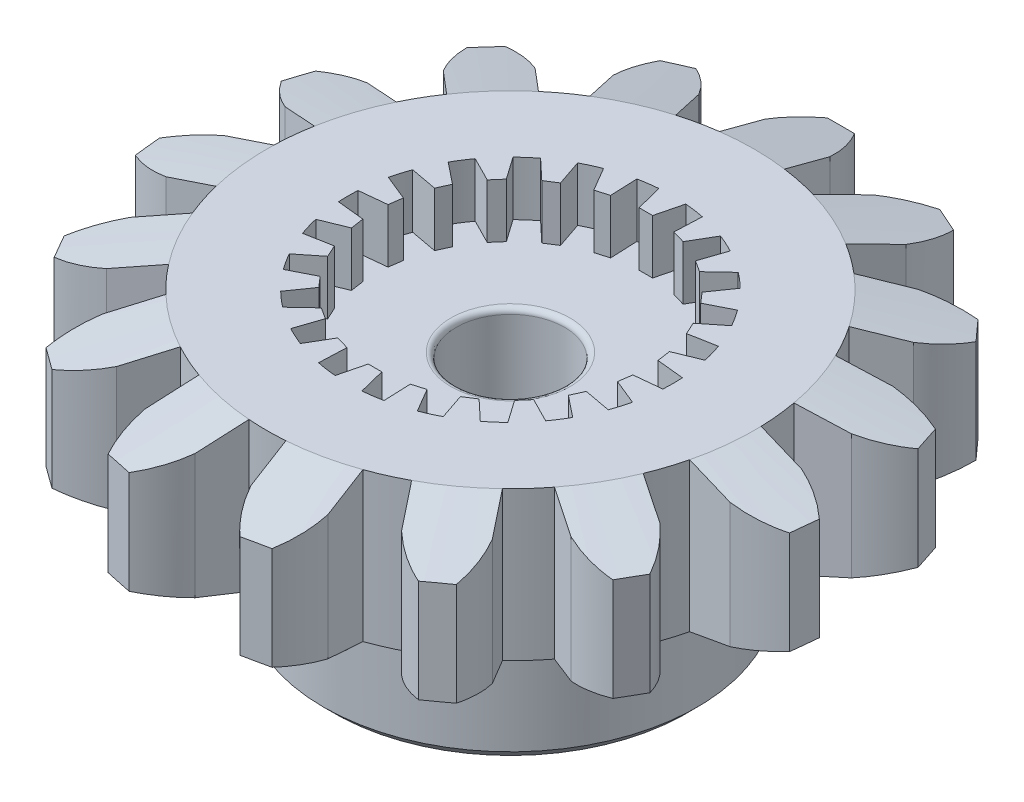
from build123d import *

# Parameters (mm, degrees)
SKETCH_1_R               = 9
EXTRUDE_1_DEPTH          = 5.5
SKETCH_2_R               = 6
CUT_EXTRUDE_1_DEPTH      = 2
EXTRUDE_START            = -5.5
EXTRUDE_2_DEPTH          = 5.5
PATTERN_CIRCULAR_1_COUNT = 15
EXTRUDE_3_DEPTH          = 2
PATTERN_CIRCULAR_2_COUNT = 22
SKETCH_5_R               = 6.9
EXTRUDE_4_DEPTH          = 4.8
CUT_EXTRUDE_2_DEPTH      = 5
FILLET_1_R               = 0.2
CUT_EXTRUDE_3_REACH      = 22.085
SKETCH_7_R               = 2
CHAMFER_1_SIZE           = 0.4
CHAMFER_2_SIZE           = 0.4
FILLET_2_R               = 0.2
CUT_EXTRUDE_4_REACH      = 20.099
CUT_EXTRUDE_4_END_RADIUS = 6.9
SKETCH_10_R              = 1.2


with BuildPart() as part:
    # Sketch 1 → Extrude 1 (new body)
    with BuildSketch(Plane(origin=(0, 0, 0), x_dir=(1, 0, 0), z_dir=(0, 1, 0))):
        with Locations(Location((0, 0, 0), (0, 0, 270))):
            Circle(SKETCH_1_R)
    extrude(amount=EXTRUDE_1_DEPTH)

    # Sketch 2 → Cut-Extrude 1 (cut)
    with BuildSketch(Plane(origin=(0, 5.5, 0), x_dir=(1, 0, 0), z_dir=(0, 1, 0))):
        with Locations(Location((0, 0, 0), (0, 0, 270))):
            Circle(SKETCH_2_R)
    extrude(amount=-CUT_EXTRUDE_1_DEPTH, mode=Mode.SUBTRACT)

    # Sketch 3 → Extrude 2 (add)
    with BuildSketch(Plane(origin=(0, 5.5, 0), x_dir=(1, 0, 0), z_dir=(0, 1, 0)).offset(EXTRUDE_START)):
        with BuildLine():
            Line((0.5, 12.2), (-0.5, 12.2))
            ThreePointArc((-0.5, 12.2), (-0.936477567, 11.437833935), (-1.2, 10.6))
            Line((-1.2, 10.6), (-1.2, 8.919641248))
            ThreePointArc((-1.2, 8.919641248), (0, 9), (1.2, 8.919641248))
            Line((1.2, 8.919641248), (1.2, 10.6))
            ThreePointArc((1.2, 10.6), (0.936477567, 11.437833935), (0.5, 12.2))
        make_face()
    extrude_2 = extrude(amount=EXTRUDE_2_DEPTH)

    # Pattern Circular 1: Extrude 2 ×15 about axis
    pattern_circular_1_axis = Axis((0, 0, 0), (0, 1, 0))
    for i in range(1, PATTERN_CIRCULAR_1_COUNT):
        add(extrude_2.rotate(pattern_circular_1_axis, i * 360 / PATTERN_CIRCULAR_1_COUNT))

    # Sketch 4 → Extrude 3 (add)
    with BuildSketch(Plane(origin=(0, 5.5, 0), x_dir=(1, 0, 0), z_dir=(0, 1, 0))):
        with BuildLine():
            Line((0.25, 5), (-0.25, 5))
            Line((-0.25, 5), (-0.494888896, 5.979555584))
            ThreePointArc((-0.494888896, 5.979555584), (0, 6), (0.494888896, 5.979555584))
            Line((0.494888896, 5.979555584), (0.25, 5))
        make_face()
    extrude_3 = extrude(amount=-EXTRUDE_3_DEPTH)

    # Pattern Circular 2: Extrude 3 ×22 about axis
    pattern_circular_2_axis = Axis((0, 0, 0), (0, 1, 0))
    for i in range(1, PATTERN_CIRCULAR_2_COUNT):
        add(extrude_3.rotate(pattern_circular_2_axis, i * 360 / PATTERN_CIRCULAR_2_COUNT))

    # Sketch 5 → Extrude 4 (add)
    with BuildSketch(Plane.XZ):
        with Locations(Location((0, 0, 0), (0, 0, 90))):
            Circle(SKETCH_5_R)
    extrude(amount=EXTRUDE_4_DEPTH)

    # Sketch 6 → Cut-Extrude 2 (cut)
    with BuildSketch(Plane(origin=(0, -4.8, 0), x_dir=(-1, 0, 0), z_dir=(0, -1, 0))):
        with BuildLine():
            Line((3, -4.369210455), (3, 4.369210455))
            ThreePointArc((3, 4.369210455), (5.3, 0), (3, -4.369210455))
        make_face()
        with BuildLine():
            Line((-3, -4.369210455), (-3, 4.369210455))
            ThreePointArc((-3, 4.369210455), (-5.3, 0), (-3, -4.369210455))
        make_face()
    extrude(amount=-CUT_EXTRUDE_2_DEPTH, mode=Mode.SUBTRACT)

    # Fillet 1
    fillet_1_edges = [part.edges().sort_by_distance(p)[0] for p in [
        (-3, -2.3, -4.369210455),
        (-3, -2.3, 4.369210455),
        (3, -2.3, 4.369210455),
        (3, -2.3, -4.369210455),
    ]]
    fillet(fillet_1_edges, radius=FILLET_1_R)

    # Sketch 7 → Cut-Extrude 3 (cut, up to next)
    with BuildSketch(Plane.XZ.offset(4.8), mode=Mode.PRIVATE) as cut_extrude_3_sk1:
        with Locations(Location((0, 0, 0), (0, 0, 270))):
            Circle(SKETCH_7_R)
    cut_extrude_3_tool1 = extrude(cut_extrude_3_sk1.sketch, amount=-CUT_EXTRUDE_3_REACH, mode=Mode.PRIVATE) & part.part
    add(cut_extrude_3_tool1.solids().sort_by_distance((0, -4.8, 0))[0], mode=Mode.SUBTRACT)

    # Chamfer 1
    chamfer_1_edges = [part.edges().sort_by_distance(p)[0] for p in [
        (3, -4.8, 0),
        (5.3, -4.8, 0),
        (-3, -4.8, 0),
        (-5.3, -4.8, 0),
        (3.113680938, -4.8, 4.151559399),
        (3.113680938, -4.8, -4.151559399),
        (-3.113680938, -4.8, -4.151559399),
        (-3.113680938, -4.8, 4.151559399),
        (0, -4.8, 2),
    ]]
    chamfer(chamfer_1_edges, length=CHAMFER_1_SIZE)

    # Chamfer 2
    chamfer_2_edges = [part.edges().sort_by_distance(p)[0] for p in [
        (0, -4.8, -6.9),
    ]]
    chamfer(chamfer_2_edges, length=CHAMFER_2_SIZE)

    # Fillet 2
    fillet_2_edges = [part.edges().sort_by_distance(p)[0] for p in [
        (0, 3.5, 2),
    ]]
    fillet(fillet_2_edges, radius=FILLET_2_R)

    # Sketch 9 → Cut-Revolve 2 (revolve, cut)
    with BuildSketch(Plane(origin=(0, 0, 0), x_dir=(0, 0, -1), z_dir=(1, 0, 0))):
        Polygon((14, 5.5), (9, 5.5), (14, 4.171875), align=None)
        Polygon((14, 1.328125), (14, 0), (9, 0), align=None)
    revolve(axis=Axis((0, 0, 0), (0, 1, 0)), mode=Mode.SUBTRACT)

    # Cut-Extrude 4: up to this cylinder (the profile starts inside it)
    cut_extrude_4_end = Plane(origin=(0, -1.3, 0), z_dir=(0, 1, 0)) * Cylinder(CUT_EXTRUDE_4_END_RADIUS, 54.998, mode=Mode.PRIVATE)
    # Sketch 10 → Cut-Extrude 4 (cut, up to the surface)
    with BuildSketch(Plane.XY, mode=Mode.PRIVATE) as cut_extrude_4_sk1:
        with Locations(Location((0, -1.3, 0), (0, 0, 180))):
            Circle(SKETCH_10_R)
    cut_extrude_4_tool1 = extrude(cut_extrude_4_sk1.sketch, amount=CUT_EXTRUDE_4_REACH, mode=Mode.PRIVATE) & cut_extrude_4_end
    add(cut_extrude_4_tool1.solids().sort_by_distance((0, -1.3, 0))[0], mode=Mode.SUBTRACT)


solid = part.part
